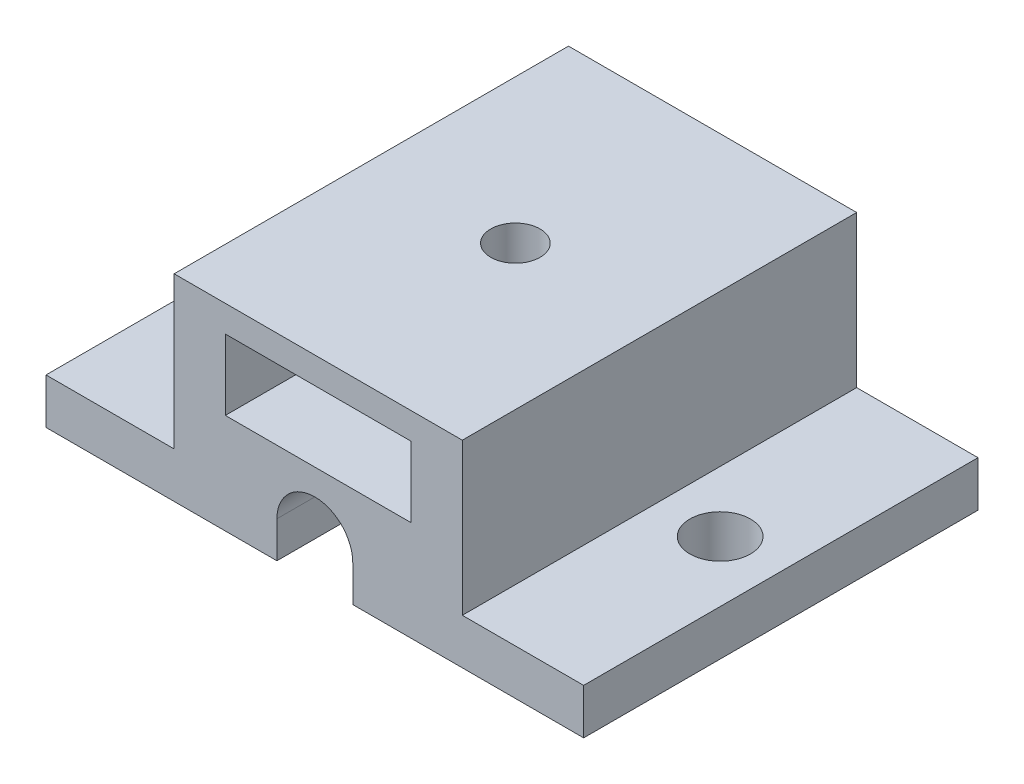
ISO-10303-21;
HEADER;
FILE_DESCRIPTION(('STEP AP214'),'2;1');
FILE_NAME('part.step','',(''),(''),'','','');
FILE_SCHEMA(('AUTOMOTIVE_DESIGN { 1 0 10303 214 1 1 1 1 }'));
ENDSEC;
DATA;
#1=APPLICATION_CONTEXT('core data for automotive mechanical design processes');
#2=APPLICATION_PROTOCOL_DEFINITION('international standard','automotive_design',2000,#1);
#3=PRODUCT_CONTEXT('',#1,'mechanical');
#4=PRODUCT('Part','Part','',(#3));
#5=PRODUCT_RELATED_PRODUCT_CATEGORY('part','',(#4));
#6=PRODUCT_DEFINITION_FORMATION('','',#4);
#7=PRODUCT_DEFINITION_CONTEXT('part definition',#1,'design');
#8=PRODUCT_DEFINITION('design','',#6,#7);
#9=PRODUCT_DEFINITION_SHAPE('','',#8);
#10=(LENGTH_UNIT() NAMED_UNIT(*) SI_UNIT(.MILLI.,.METRE.));
#11=(NAMED_UNIT(*) PLANE_ANGLE_UNIT() SI_UNIT($,.RADIAN.));
#12=(NAMED_UNIT(*) SI_UNIT($,.STERADIAN.) SOLID_ANGLE_UNIT());
#13=UNCERTAINTY_MEASURE_WITH_UNIT(LENGTH_MEASURE(1.E-05),#10,'distance_accuracy_value','');
#14=(GEOMETRIC_REPRESENTATION_CONTEXT(3) GLOBAL_UNCERTAINTY_ASSIGNED_CONTEXT((#13)) GLOBAL_UNIT_ASSIGNED_CONTEXT((#10,
#11,#12)) REPRESENTATION_CONTEXT('',''));
#15=CARTESIAN_POINT('',(0.,0.,0.));
#16=DIRECTION('',(0.,0.,1.));
#17=DIRECTION('',(1.,0.,0.));
#18=AXIS2_PLACEMENT_3D('',#15,#16,#17);
#19=CARTESIAN_POINT('',(35.4483122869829,0.,26.));
#20=DIRECTION('',(0.,1.,0.));
#21=DIRECTION('',(0.,0.,1.));
#22=AXIS2_PLACEMENT_3D('',#19,#20,#21);
#23=PLANE('',#22);
#24=CARTESIAN_POINT('',(4.,0.,13.));
#25=DIRECTION('',(0.,1.,0.));
#26=DIRECTION('',(0.,0.,1.));
#27=AXIS2_PLACEMENT_3D('',#24,#25,#26);
#28=CIRCLE('',#27,2.);
#29=CARTESIAN_POINT('',(4.,0.,15.));
#30=VERTEX_POINT('',#29);
#31=EDGE_CURVE('E251',#30,#30,#28,.T.);
#32=ORIENTED_EDGE('',*,*,#31,.T.);
#33=EDGE_LOOP('',(#32));
#34=FACE_BOUND('',#33,.T.);
#35=DIRECTION('',(1.,0.,0.));
#36=VECTOR('',#35,1.);
#37=CARTESIAN_POINT('',(35.4483122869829,0.,0.));
#38=LINE('',#37,#36);
#39=CARTESIAN_POINT('',(0.,0.,0.));
#40=VERTEX_POINT('',#39);
#41=CARTESIAN_POINT('',(15.225,0.,0.));
#42=VERTEX_POINT('',#41);
#43=EDGE_CURVE('E290',#40,#42,#38,.T.);
#44=ORIENTED_EDGE('',*,*,#43,.T.);
#45=DIRECTION('',(0.,0.,-1.));
#46=VECTOR('',#45,1.);
#47=CARTESIAN_POINT('',(15.225,0.,26.));
#48=LINE('',#47,#46);
#49=CARTESIAN_POINT('',(15.225,0.,26.));
#50=VERTEX_POINT('',#49);
#51=EDGE_CURVE('E238',#50,#42,#48,.T.);
#52=ORIENTED_EDGE('',*,*,#51,.F.);
#53=DIRECTION('',(1.,0.,0.));
#54=VECTOR('',#53,1.);
#55=CARTESIAN_POINT('',(35.4483122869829,0.,26.));
#56=LINE('',#55,#54);
#57=CARTESIAN_POINT('',(0.,0.,26.));
#58=VERTEX_POINT('',#57);
#59=EDGE_CURVE('E263',#58,#50,#56,.T.);
#60=ORIENTED_EDGE('',*,*,#59,.F.);
#61=DIRECTION('',(0.,0.,-1.));
#62=VECTOR('',#61,1.);
#63=CARTESIAN_POINT('',(0.,0.,26.));
#64=LINE('',#63,#62);
#65=EDGE_CURVE('E289',#58,#40,#64,.T.);
#66=ORIENTED_EDGE('',*,*,#65,.T.);
#67=EDGE_LOOP('',(#44,#52,#60,#66));
#68=FACE_BOUND('',#67,.T.);
#69=ADVANCED_FACE('F38',(#34,#68),#23,.F.);
#70=CARTESIAN_POINT('',(31.4483122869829,0.,13.));
#71=DIRECTION('',(0.,1.,0.));
#72=DIRECTION('',(0.,0.,1.));
#73=AXIS2_PLACEMENT_3D('',#70,#71,#72);
#74=CIRCLE('',#73,2.00000000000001);
#75=CARTESIAN_POINT('',(31.4483122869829,0.,15.));
#76=VERTEX_POINT('',#75);
#77=EDGE_CURVE('E258',#76,#76,#74,.T.);
#78=ORIENTED_EDGE('',*,*,#77,.T.);
#79=EDGE_LOOP('',(#78));
#80=FACE_BOUND('',#79,.T.);
#81=CARTESIAN_POINT('',(20.225,0.,26.));
#82=VERTEX_POINT('',#81);
#83=CARTESIAN_POINT('',(35.4483122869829,0.,26.));
#84=VERTEX_POINT('',#83);
#85=EDGE_CURVE('E268',#82,#84,#56,.T.);
#86=ORIENTED_EDGE('',*,*,#85,.F.);
#87=DIRECTION('',(0.,0.,-1.));
#88=VECTOR('',#87,1.);
#89=CARTESIAN_POINT('',(20.225,0.,26.));
#90=LINE('',#89,#88);
#91=CARTESIAN_POINT('',(20.225,0.,0.));
#92=VERTEX_POINT('',#91);
#93=EDGE_CURVE('E241',#82,#92,#90,.T.);
#94=ORIENTED_EDGE('',*,*,#93,.T.);
#95=CARTESIAN_POINT('',(35.4483122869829,0.,0.));
#96=VERTEX_POINT('',#95);
#97=EDGE_CURVE('E262',#92,#96,#38,.T.);
#98=ORIENTED_EDGE('',*,*,#97,.T.);
#99=DIRECTION('',(0.,0.,-1.));
#100=VECTOR('',#99,1.);
#101=CARTESIAN_POINT('',(35.4483122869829,0.,26.));
#102=LINE('',#101,#100);
#103=EDGE_CURVE('E11',#84,#96,#102,.T.);
#104=ORIENTED_EDGE('',*,*,#103,.F.);
#105=EDGE_LOOP('',(#86,#94,#98,#104));
#106=FACE_BOUND('',#105,.T.);
#107=ADVANCED_FACE('F40',(#80,#106),#23,.F.);
#108=CARTESIAN_POINT('',(35.4483122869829,0.,26.));
#109=DIRECTION('',(-1.,0.,0.));
#110=DIRECTION('',(0.,-1.,0.));
#111=AXIS2_PLACEMENT_3D('',#108,#109,#110);
#112=PLANE('',#111);
#113=DIRECTION('',(0.,1.,0.));
#114=VECTOR('',#113,1.);
#115=CARTESIAN_POINT('',(35.4483122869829,0.,0.));
#116=LINE('',#115,#114);
#117=CARTESIAN_POINT('',(35.4483122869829,3.,0.));
#118=VERTEX_POINT('',#117);
#119=EDGE_CURVE('E294',#96,#118,#116,.T.);
#120=ORIENTED_EDGE('',*,*,#119,.T.);
#121=DIRECTION('',(0.,0.,-1.));
#122=VECTOR('',#121,1.);
#123=CARTESIAN_POINT('',(35.4483122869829,3.,26.));
#124=LINE('',#123,#122);
#125=CARTESIAN_POINT('',(35.4483122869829,3.,26.));
#126=VERTEX_POINT('',#125);
#127=EDGE_CURVE('E53',#126,#118,#124,.T.);
#128=ORIENTED_EDGE('',*,*,#127,.F.);
#129=DIRECTION('',(0.,1.,0.));
#130=VECTOR('',#129,1.);
#131=CARTESIAN_POINT('',(35.4483122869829,0.,26.));
#132=LINE('',#131,#130);
#133=EDGE_CURVE('E267',#84,#126,#132,.T.);
#134=ORIENTED_EDGE('',*,*,#133,.F.);
#135=ORIENTED_EDGE('',*,*,#103,.T.);
#136=EDGE_LOOP('',(#120,#128,#134,#135));
#137=FACE_BOUND('',#136,.T.);
#138=ADVANCED_FACE('F369',(#137),#112,.F.);
#139=CARTESIAN_POINT('',(35.4483122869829,3.,26.));
#140=DIRECTION('',(0.,-1.,0.));
#141=DIRECTION('',(1.,0.,0.));
#142=AXIS2_PLACEMENT_3D('',#139,#140,#141);
#143=PLANE('',#142);
#144=CARTESIAN_POINT('',(31.4483122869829,3.,13.));
#145=DIRECTION('',(0.,1.,0.));
#146=DIRECTION('',(0.,0.,1.));
#147=AXIS2_PLACEMENT_3D('',#144,#145,#146);
#148=CIRCLE('',#147,2.00000000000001);
#149=CARTESIAN_POINT('',(31.4483122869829,3.,15.));
#150=VERTEX_POINT('',#149);
#151=EDGE_CURVE('E237',#150,#150,#148,.T.);
#152=ORIENTED_EDGE('',*,*,#151,.F.);
#153=EDGE_LOOP('',(#152));
#154=FACE_BOUND('',#153,.T.);
#155=DIRECTION('',(-1.,0.,0.));
#156=VECTOR('',#155,1.);
#157=CARTESIAN_POINT('',(35.4483122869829,3.,0.));
#158=LINE('',#157,#156);
#159=CARTESIAN_POINT('',(27.4483122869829,3.,0.));
#160=VERTEX_POINT('',#159);
#161=EDGE_CURVE('E297',#118,#160,#158,.T.);
#162=ORIENTED_EDGE('',*,*,#161,.T.);
#163=DIRECTION('',(0.,0.,-1.));
#164=VECTOR('',#163,1.);
#165=CARTESIAN_POINT('',(27.4483122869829,3.,26.));
#166=LINE('',#165,#164);
#167=CARTESIAN_POINT('',(27.4483122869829,3.,26.));
#168=VERTEX_POINT('',#167);
#169=EDGE_CURVE('E334',#168,#160,#166,.T.);
#170=ORIENTED_EDGE('',*,*,#169,.F.);
#171=DIRECTION('',(-1.,0.,0.));
#172=VECTOR('',#171,1.);
#173=CARTESIAN_POINT('',(35.4483122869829,3.,26.));
#174=LINE('',#173,#172);
#175=EDGE_CURVE('E271',#126,#168,#174,.T.);
#176=ORIENTED_EDGE('',*,*,#175,.F.);
#177=ORIENTED_EDGE('',*,*,#127,.T.);
#178=EDGE_LOOP('',(#162,#170,#176,#177));
#179=FACE_BOUND('',#178,.T.);
#180=ADVANCED_FACE('F344',(#154,#179),#143,.F.);
#181=CARTESIAN_POINT('',(27.4483122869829,3.,26.));
#182=DIRECTION('',(-1.,0.,0.));
#183=DIRECTION('',(0.,0.,1.));
#184=AXIS2_PLACEMENT_3D('',#181,#182,#183);
#185=PLANE('',#184);
#186=DIRECTION('',(0.,1.,0.));
#187=VECTOR('',#186,1.);
#188=CARTESIAN_POINT('',(27.4483122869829,3.,0.));
#189=LINE('',#188,#187);
#190=CARTESIAN_POINT('',(27.4483122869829,13.,0.));
#191=VERTEX_POINT('',#190);
#192=EDGE_CURVE('E300',#160,#191,#189,.T.);
#193=ORIENTED_EDGE('',*,*,#192,.T.);
#194=DIRECTION('',(0.,0.,-1.));
#195=VECTOR('',#194,1.);
#196=CARTESIAN_POINT('',(27.4483122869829,13.,26.));
#197=LINE('',#196,#195);
#198=CARTESIAN_POINT('',(27.4483122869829,13.,26.));
#199=VERTEX_POINT('',#198);
#200=EDGE_CURVE('E330',#199,#191,#197,.T.);
#201=ORIENTED_EDGE('',*,*,#200,.F.);
#202=DIRECTION('',(0.,1.,0.));
#203=VECTOR('',#202,1.);
#204=CARTESIAN_POINT('',(27.4483122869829,3.,26.));
#205=LINE('',#204,#203);
#206=EDGE_CURVE('E274',#168,#199,#205,.T.);
#207=ORIENTED_EDGE('',*,*,#206,.F.);
#208=ORIENTED_EDGE('',*,*,#169,.T.);
#209=EDGE_LOOP('',(#193,#201,#207,#208));
#210=FACE_BOUND('',#209,.T.);
#211=ADVANCED_FACE('F357',(#210),#185,.F.);
#212=CARTESIAN_POINT('',(27.4483122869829,13.,26.));
#213=DIRECTION('',(0.,-1.,0.));
#214=DIRECTION('',(0.,0.,-1.));
#215=AXIS2_PLACEMENT_3D('',#212,#213,#214);
#216=PLANE('',#215);
#217=CARTESIAN_POINT('',(17.9483122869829,13.,13.));
#218=DIRECTION('',(0.,1.,0.));
#219=DIRECTION('',(0.,0.,1.));
#220=AXIS2_PLACEMENT_3D('',#217,#218,#219);
#221=CIRCLE('',#220,1.625);
#222=CARTESIAN_POINT('',(17.9483122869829,13.,14.625));
#223=VERTEX_POINT('',#222);
#224=EDGE_CURVE('E203',#223,#223,#221,.T.);
#225=ORIENTED_EDGE('',*,*,#224,.F.);
#226=EDGE_LOOP('',(#225));
#227=FACE_BOUND('',#226,.T.);
#228=DIRECTION('',(-1.,0.,0.));
#229=VECTOR('',#228,1.);
#230=CARTESIAN_POINT('',(27.4483122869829,13.,0.));
#231=LINE('',#230,#229);
#232=CARTESIAN_POINT('',(8.44831228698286,13.,0.));
#233=VERTEX_POINT('',#232);
#234=EDGE_CURVE('E303',#191,#233,#231,.T.);
#235=ORIENTED_EDGE('',*,*,#234,.T.);
#236=DIRECTION('',(0.,0.,-1.));
#237=VECTOR('',#236,1.);
#238=CARTESIAN_POINT('',(8.44831228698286,13.,26.));
#239=LINE('',#238,#237);
#240=CARTESIAN_POINT('',(8.44831228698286,13.,26.));
#241=VERTEX_POINT('',#240);
#242=EDGE_CURVE('E326',#241,#233,#239,.T.);
#243=ORIENTED_EDGE('',*,*,#242,.F.);
#244=DIRECTION('',(-1.,0.,0.));
#245=VECTOR('',#244,1.);
#246=CARTESIAN_POINT('',(27.4483122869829,13.,26.));
#247=LINE('',#246,#245);
#248=EDGE_CURVE('E277',#199,#241,#247,.T.);
#249=ORIENTED_EDGE('',*,*,#248,.F.);
#250=ORIENTED_EDGE('',*,*,#200,.T.);
#251=EDGE_LOOP('',(#235,#243,#249,#250));
#252=FACE_BOUND('',#251,.T.);
#253=ADVANCED_FACE('F361',(#227,#252),#216,.F.);
#254=CARTESIAN_POINT('',(8.44831228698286,13.,26.));
#255=DIRECTION('',(1.,0.,0.));
#256=DIRECTION('',(0.,1.,0.));
#257=AXIS2_PLACEMENT_3D('',#254,#255,#256);
#258=PLANE('',#257);
#259=DIRECTION('',(0.,-1.,0.));
#260=VECTOR('',#259,1.);
#261=CARTESIAN_POINT('',(8.44831228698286,13.,0.));
#262=LINE('',#261,#260);
#263=CARTESIAN_POINT('',(8.44831228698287,3.,0.));
#264=VERTEX_POINT('',#263);
#265=EDGE_CURVE('E306',#233,#264,#262,.T.);
#266=ORIENTED_EDGE('',*,*,#265,.T.);
#267=DIRECTION('',(0.,0.,-1.));
#268=VECTOR('',#267,1.);
#269=CARTESIAN_POINT('',(8.44831228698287,3.,26.));
#270=LINE('',#269,#268);
#271=CARTESIAN_POINT('',(8.44831228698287,3.,26.));
#272=VERTEX_POINT('',#271);
#273=EDGE_CURVE('E322',#272,#264,#270,.T.);
#274=ORIENTED_EDGE('',*,*,#273,.F.);
#275=DIRECTION('',(0.,-1.,0.));
#276=VECTOR('',#275,1.);
#277=CARTESIAN_POINT('',(8.44831228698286,13.,26.));
#278=LINE('',#277,#276);
#279=EDGE_CURVE('E280',#241,#272,#278,.T.);
#280=ORIENTED_EDGE('',*,*,#279,.F.);
#281=ORIENTED_EDGE('',*,*,#242,.T.);
#282=EDGE_LOOP('',(#266,#274,#280,#281));
#283=FACE_BOUND('',#282,.T.);
#284=ADVANCED_FACE('F419',(#283),#258,.F.);
#285=CARTESIAN_POINT('',(8.44831228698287,3.,26.));
#286=DIRECTION('',(0.,-1.,0.));
#287=DIRECTION('',(1.,0.,0.));
#288=AXIS2_PLACEMENT_3D('',#285,#286,#287);
#289=PLANE('',#288);
#290=CARTESIAN_POINT('',(4.,3.,13.));
#291=DIRECTION('',(0.,1.,0.));
#292=DIRECTION('',(0.,0.,1.));
#293=AXIS2_PLACEMENT_3D('',#290,#291,#292);
#294=CIRCLE('',#293,2.);
#295=CARTESIAN_POINT('',(4.,3.,15.));
#296=VERTEX_POINT('',#295);
#297=EDGE_CURVE('E247',#296,#296,#294,.T.);
#298=ORIENTED_EDGE('',*,*,#297,.F.);
#299=EDGE_LOOP('',(#298));
#300=FACE_BOUND('',#299,.T.);
#301=DIRECTION('',(-1.,0.,0.));
#302=VECTOR('',#301,1.);
#303=CARTESIAN_POINT('',(8.44831228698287,3.,0.));
#304=LINE('',#303,#302);
#305=CARTESIAN_POINT('',(0.,3.,0.));
#306=VERTEX_POINT('',#305);
#307=EDGE_CURVE('E309',#264,#306,#304,.T.);
#308=ORIENTED_EDGE('',*,*,#307,.T.);
#309=DIRECTION('',(0.,0.,-1.));
#310=VECTOR('',#309,1.);
#311=CARTESIAN_POINT('',(0.,3.,26.));
#312=LINE('',#311,#310);
#313=CARTESIAN_POINT('',(0.,3.,26.));
#314=VERTEX_POINT('',#313);
#315=EDGE_CURVE('E318',#314,#306,#312,.T.);
#316=ORIENTED_EDGE('',*,*,#315,.F.);
#317=DIRECTION('',(-1.,0.,0.));
#318=VECTOR('',#317,1.);
#319=CARTESIAN_POINT('',(8.44831228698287,3.,26.));
#320=LINE('',#319,#318);
#321=EDGE_CURVE('E283',#272,#314,#320,.T.);
#322=ORIENTED_EDGE('',*,*,#321,.F.);
#323=ORIENTED_EDGE('',*,*,#273,.T.);
#324=EDGE_LOOP('',(#308,#316,#322,#323));
#325=FACE_BOUND('',#324,.T.);
#326=ADVANCED_FACE('F417',(#300,#325),#289,.F.);
#327=CARTESIAN_POINT('',(0.,3.,26.));
#328=DIRECTION('',(1.,0.,0.));
#329=DIRECTION('',(0.,1.,0.));
#330=AXIS2_PLACEMENT_3D('',#327,#328,#329);
#331=PLANE('',#330);
#332=DIRECTION('',(0.,-1.,0.));
#333=VECTOR('',#332,1.);
#334=CARTESIAN_POINT('',(0.,3.,0.));
#335=LINE('',#334,#333);
#336=EDGE_CURVE('E312',#306,#40,#335,.T.);
#337=ORIENTED_EDGE('',*,*,#336,.T.);
#338=ORIENTED_EDGE('',*,*,#65,.F.);
#339=DIRECTION('',(0.,-1.,0.));
#340=VECTOR('',#339,1.);
#341=CARTESIAN_POINT('',(0.,3.,26.));
#342=LINE('',#341,#340);
#343=EDGE_CURVE('E286',#314,#58,#342,.T.);
#344=ORIENTED_EDGE('',*,*,#343,.F.);
#345=ORIENTED_EDGE('',*,*,#315,.T.);
#346=EDGE_LOOP('',(#337,#338,#344,#345));
#347=FACE_BOUND('',#346,.T.);
#348=ADVANCED_FACE('F415',(#347),#331,.F.);
#349=CARTESIAN_POINT('',(0.,0.,26.));
#350=DIRECTION('',(0.,0.,1.));
#351=DIRECTION('',(1.,0.,0.));
#352=AXIS2_PLACEMENT_3D('',#349,#350,#351);
#353=PLANE('',#352);
#354=DIRECTION('',(0.,-1.,0.));
#355=VECTOR('',#354,1.);
#356=CARTESIAN_POINT('',(11.8233122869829,11.25,26.));
#357=LINE('',#356,#355);
#358=CARTESIAN_POINT('',(11.8233122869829,11.25,26.));
#359=VERTEX_POINT('',#358);
#360=CARTESIAN_POINT('',(11.8233122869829,6.6,26.));
#361=VERTEX_POINT('',#360);
#362=EDGE_CURVE('E60',#359,#361,#357,.T.);
#363=ORIENTED_EDGE('',*,*,#362,.F.);
#364=DIRECTION('',(-1.,0.,0.));
#365=VECTOR('',#364,1.);
#366=CARTESIAN_POINT('',(11.8233122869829,11.25,26.));
#367=LINE('',#366,#365);
#368=CARTESIAN_POINT('',(24.0733122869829,11.25,26.));
#369=VERTEX_POINT('',#368);
#370=EDGE_CURVE('E181',#369,#359,#367,.T.);
#371=ORIENTED_EDGE('',*,*,#370,.F.);
#372=DIRECTION('',(0.,1.,0.));
#373=VECTOR('',#372,1.);
#374=CARTESIAN_POINT('',(24.0733122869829,11.25,26.));
#375=LINE('',#374,#373);
#376=CARTESIAN_POINT('',(24.0733122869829,6.6,26.));
#377=VERTEX_POINT('',#376);
#378=EDGE_CURVE('E185',#377,#369,#375,.T.);
#379=ORIENTED_EDGE('',*,*,#378,.F.);
#380=DIRECTION('',(1.,0.,0.));
#381=VECTOR('',#380,1.);
#382=CARTESIAN_POINT('',(11.8233122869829,6.6,26.));
#383=LINE('',#382,#381);
#384=EDGE_CURVE('E194',#361,#377,#383,.T.);
#385=ORIENTED_EDGE('',*,*,#384,.F.);
#386=EDGE_LOOP('',(#363,#371,#379,#385));
#387=FACE_BOUND('',#386,.T.);
#388=DIRECTION('',(0.,1.,0.));
#389=VECTOR('',#388,1.);
#390=CARTESIAN_POINT('',(15.225,2.4,26.));
#391=LINE('',#390,#389);
#392=CARTESIAN_POINT('',(15.225,2.4,26.));
#393=VERTEX_POINT('',#392);
#394=EDGE_CURVE('E221',#50,#393,#391,.T.);
#395=ORIENTED_EDGE('',*,*,#394,.T.);
#396=CARTESIAN_POINT('',(17.725,2.4,26.));
#397=DIRECTION('',(0.,0.,-1.));
#398=DIRECTION('',(-1.,0.,0.));
#399=AXIS2_PLACEMENT_3D('',#396,#397,#398);
#400=CIRCLE('',#399,2.5);
#401=CARTESIAN_POINT('',(20.225,2.4,26.));
#402=VERTEX_POINT('',#401);
#403=EDGE_CURVE('E212',#393,#402,#400,.T.);
#404=ORIENTED_EDGE('',*,*,#403,.T.);
#405=DIRECTION('',(0.,-1.,0.));
#406=VECTOR('',#405,1.);
#407=CARTESIAN_POINT('',(20.225,2.4,26.));
#408=LINE('',#407,#406);
#409=EDGE_CURVE('E216',#402,#82,#408,.T.);
#410=ORIENTED_EDGE('',*,*,#409,.T.);
#411=ORIENTED_EDGE('',*,*,#85,.T.);
#412=ORIENTED_EDGE('',*,*,#133,.T.);
#413=ORIENTED_EDGE('',*,*,#175,.T.);
#414=ORIENTED_EDGE('',*,*,#206,.T.);
#415=ORIENTED_EDGE('',*,*,#248,.T.);
#416=ORIENTED_EDGE('',*,*,#279,.T.);
#417=ORIENTED_EDGE('',*,*,#321,.T.);
#418=ORIENTED_EDGE('',*,*,#343,.T.);
#419=ORIENTED_EDGE('',*,*,#59,.T.);
#420=EDGE_LOOP('',(#395,#404,#410,#411,#412,#413,#414,#415,#416,#417,#418,#419));
#421=FACE_BOUND('',#420,.T.);
#422=ADVANCED_FACE('F365',(#387,#421),#353,.T.);
#423=CARTESIAN_POINT('',(0.,0.,0.));
#424=DIRECTION('',(0.,0.,1.));
#425=DIRECTION('',(1.,0.,0.));
#426=AXIS2_PLACEMENT_3D('',#423,#424,#425);
#427=PLANE('',#426);
#428=CARTESIAN_POINT('',(17.725,2.4,0.));
#429=DIRECTION('',(0.,0.,-1.));
#430=DIRECTION('',(-1.,0.,0.));
#431=AXIS2_PLACEMENT_3D('',#428,#429,#430);
#432=CIRCLE('',#431,2.5);
#433=CARTESIAN_POINT('',(15.225,2.4,0.));
#434=VERTEX_POINT('',#433);
#435=CARTESIAN_POINT('',(20.225,2.4,0.));
#436=VERTEX_POINT('',#435);
#437=EDGE_CURVE('E68',#434,#436,#432,.T.);
#438=ORIENTED_EDGE('',*,*,#437,.F.);
#439=DIRECTION('',(0.,1.,0.));
#440=VECTOR('',#439,1.);
#441=CARTESIAN_POINT('',(15.225,2.4,0.));
#442=LINE('',#441,#440);
#443=EDGE_CURVE('E217',#42,#434,#442,.T.);
#444=ORIENTED_EDGE('',*,*,#443,.F.);
#445=ORIENTED_EDGE('',*,*,#43,.F.);
#446=ORIENTED_EDGE('',*,*,#336,.F.);
#447=ORIENTED_EDGE('',*,*,#307,.F.);
#448=ORIENTED_EDGE('',*,*,#265,.F.);
#449=ORIENTED_EDGE('',*,*,#234,.F.);
#450=ORIENTED_EDGE('',*,*,#192,.F.);
#451=ORIENTED_EDGE('',*,*,#161,.F.);
#452=ORIENTED_EDGE('',*,*,#119,.F.);
#453=ORIENTED_EDGE('',*,*,#97,.F.);
#454=DIRECTION('',(0.,-1.,0.));
#455=VECTOR('',#454,1.);
#456=CARTESIAN_POINT('',(20.225,2.4,0.));
#457=LINE('',#456,#455);
#458=EDGE_CURVE('E228',#436,#92,#457,.T.);
#459=ORIENTED_EDGE('',*,*,#458,.F.);
#460=EDGE_LOOP('',(#438,#444,#445,#446,#447,#448,#449,#450,#451,#452,#453,#459));
#461=FACE_BOUND('',#460,.T.);
#462=ADVANCED_FACE('F351',(#461),#427,.F.);
#463=CARTESIAN_POINT('',(4.,-17.,13.));
#464=DIRECTION('',(0.,1.,0.));
#465=DIRECTION('',(0.,0.,1.));
#466=AXIS2_PLACEMENT_3D('',#463,#464,#465);
#467=CYLINDRICAL_SURFACE('',#466,2.);
#468=ORIENTED_EDGE('',*,*,#297,.T.);
#469=EDGE_LOOP('',(#468));
#470=FACE_BOUND('',#469,.T.);
#471=ORIENTED_EDGE('',*,*,#31,.F.);
#472=EDGE_LOOP('',(#471));
#473=FACE_BOUND('',#472,.T.);
#474=ADVANCED_FACE('F540',(#470,#473),#467,.F.);
#475=CARTESIAN_POINT('',(31.4483122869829,-17.,13.));
#476=DIRECTION('',(0.,1.,0.));
#477=DIRECTION('',(0.,0.,1.));
#478=AXIS2_PLACEMENT_3D('',#475,#476,#477);
#479=CYLINDRICAL_SURFACE('',#478,2.00000000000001);
#480=ORIENTED_EDGE('',*,*,#151,.T.);
#481=EDGE_LOOP('',(#480));
#482=FACE_BOUND('',#481,.T.);
#483=ORIENTED_EDGE('',*,*,#77,.F.);
#484=EDGE_LOOP('',(#483));
#485=FACE_BOUND('',#484,.T.);
#486=ADVANCED_FACE('F468',(#482,#485),#479,.F.);
#487=CARTESIAN_POINT('',(17.725,2.4,26.));
#488=DIRECTION('',(0.,0.,-1.));
#489=DIRECTION('',(-1.,0.,0.));
#490=AXIS2_PLACEMENT_3D('',#487,#488,#489);
#491=CYLINDRICAL_SURFACE('',#490,2.5);
#492=CARTESIAN_POINT('',(17.9483122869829,4.89000634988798,14.625));
#493=CARTESIAN_POINT('',(18.0324630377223,4.88245195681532,14.6249919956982));
#494=CARTESIAN_POINT('',(18.1163573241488,4.87058699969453,14.6184139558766));
#495=CARTESIAN_POINT('',(18.2808107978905,4.83888067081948,14.5928095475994));
#496=CARTESIAN_POINT('',(18.3613588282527,4.81901466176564,14.5737446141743));
#497=CARTESIAN_POINT('',(18.5163773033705,4.77280856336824,14.5246292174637));
#498=CARTESIAN_POINT('',(18.5908844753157,4.74651223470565,14.494652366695));
#499=CARTESIAN_POINT('',(18.73310019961,4.68902240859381,14.425132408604));
#500=CARTESIAN_POINT('',(18.8008128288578,4.65783187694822,14.3855950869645));
#501=CARTESIAN_POINT('',(18.9359324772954,4.58861145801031,14.2933095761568));
#502=CARTESIAN_POINT('',(19.0024767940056,4.55020667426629,14.239583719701));
#503=CARTESIAN_POINT('',(19.1260571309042,4.47181370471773,14.1228473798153));
#504=CARTESIAN_POINT('',(19.183070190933,4.43182197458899,14.0598151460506));
#505=CARTESIAN_POINT('',(19.2957167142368,4.3464394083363,13.9137984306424));
#506=CARTESIAN_POINT('',(19.3495008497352,4.30127354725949,13.8292415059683));
#507=CARTESIAN_POINT('',(19.4415968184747,4.21854720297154,13.6487726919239));
#508=CARTESIAN_POINT('',(19.4799631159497,4.18096018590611,13.5529023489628));
#509=CARTESIAN_POINT('',(19.5267396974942,4.13331390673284,13.3913794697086));
#510=CARTESIAN_POINT('',(19.5409948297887,4.11825361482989,13.3289072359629));
#511=CARTESIAN_POINT('',(19.5620664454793,4.09570937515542,13.2014358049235));
#512=CARTESIAN_POINT('',(19.5688976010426,4.08821048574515,13.1364418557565));
#513=CARTESIAN_POINT('',(19.5746311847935,4.08192974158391,13.0053787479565));
#514=CARTESIAN_POINT('',(19.5734991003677,4.08318583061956,12.9393061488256));
#515=CARTESIAN_POINT('',(19.5633243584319,4.09428848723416,12.8084812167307));
#516=CARTESIAN_POINT('',(19.5542724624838,4.10414508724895,12.7437305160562));
#517=CARTESIAN_POINT('',(19.5262416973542,4.13378726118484,12.6039408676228));
#518=CARTESIAN_POINT('',(19.5055756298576,4.15522487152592,12.5296016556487));
#519=CARTESIAN_POINT('',(19.4550143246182,4.20507822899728,12.3866011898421));
#520=CARTESIAN_POINT('',(19.4250974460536,4.23351030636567,12.3179537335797));
#521=CARTESIAN_POINT('',(19.3453757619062,4.30476424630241,12.1641047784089));
#522=CARTESIAN_POINT('',(19.2922702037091,4.34916838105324,12.0813515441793));
#523=CARTESIAN_POINT('',(19.1726880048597,4.4395691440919,11.9271258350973));
#524=CARTESIAN_POINT('',(19.1061980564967,4.48556731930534,11.8556647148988));
#525=CARTESIAN_POINT('',(18.9597161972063,4.57553508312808,11.724276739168));
#526=CARTESIAN_POINT('',(18.8795792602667,4.61947563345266,11.6644903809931));
#527=CARTESIAN_POINT('',(18.7073436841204,4.70087396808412,11.5596509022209));
#528=CARTESIAN_POINT('',(18.6152720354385,4.73834594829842,11.5145653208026));
#529=CARTESIAN_POINT('',(18.445441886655,4.79517726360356,11.4509559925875));
#530=CARTESIAN_POINT('',(18.3698414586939,4.81672310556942,11.4286119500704));
#531=CARTESIAN_POINT('',(18.2146126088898,4.85287790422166,11.3950079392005));
#532=CARTESIAN_POINT('',(18.1349870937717,4.86749178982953,11.3837400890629));
#533=CARTESIAN_POINT('',(17.9735964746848,4.8889452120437,11.373179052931));
#534=CARTESIAN_POINT('',(17.8918247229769,4.89575668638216,11.3739289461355));
#535=CARTESIAN_POINT('',(17.7290546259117,4.90132248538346,11.387789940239));
#536=CARTESIAN_POINT('',(17.6480563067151,4.90007653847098,11.4009014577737));
#537=CARTESIAN_POINT('',(17.4939284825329,4.8904290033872,11.4379216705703));
#538=CARTESIAN_POINT('',(17.4206131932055,4.88243701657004,11.4611762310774));
#539=CARTESIAN_POINT('',(17.2787065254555,4.86088970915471,11.5174067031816));
#540=CARTESIAN_POINT('',(17.2101160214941,4.84733336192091,11.550384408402));
#541=CARTESIAN_POINT('',(17.0743449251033,4.81492343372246,11.6276558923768));
#542=CARTESIAN_POINT('',(17.0075969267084,4.79576615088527,11.6725788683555));
#543=CARTESIAN_POINT('',(16.8819648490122,4.75450042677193,11.7712132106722));
#544=CARTESIAN_POINT('',(16.8230859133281,4.73239007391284,11.8249302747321));
#545=CARTESIAN_POINT('',(16.7064476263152,4.68408838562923,11.9480765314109));
#546=CARTESIAN_POINT('',(16.6499514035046,4.65775347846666,12.0186503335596));
#547=CARTESIAN_POINT('',(16.5491174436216,4.60691996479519,12.1687015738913));
#548=CARTESIAN_POINT('',(16.5047892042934,4.58242280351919,12.2481858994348));
#549=CARTESIAN_POINT('',(16.4280906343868,4.53777509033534,12.4181237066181));
#550=CARTESIAN_POINT('',(16.3962786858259,4.51784131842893,12.5088914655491));
#551=CARTESIAN_POINT('',(16.3490959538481,4.4875125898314,12.6960462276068));
#552=CARTESIAN_POINT('',(16.3336865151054,4.47709521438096,12.7924194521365));
#553=CARTESIAN_POINT('',(16.3214429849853,4.46883104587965,12.9721610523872));
#554=CARTESIAN_POINT('',(16.3221513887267,4.46932092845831,13.0552911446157));
#555=CARTESIAN_POINT('',(16.3361539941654,4.47874382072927,13.2200065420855));
#556=CARTESIAN_POINT('',(16.34945221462,4.48767952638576,13.3015913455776));
#557=CARTESIAN_POINT('',(16.3864780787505,4.51158594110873,13.4550747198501));
#558=CARTESIAN_POINT('',(16.4093957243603,4.52608165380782,13.5272493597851));
#559=CARTESIAN_POINT('',(16.4645620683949,4.55924290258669,13.666897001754));
#560=CARTESIAN_POINT('',(16.496813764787,4.57790977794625,13.7343684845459));
#561=CARTESIAN_POINT('',(16.5752130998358,4.62041706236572,13.8731965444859));
#562=CARTESIAN_POINT('',(16.6227006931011,4.6446149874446,13.9436869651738));
#563=CARTESIAN_POINT('',(16.7280055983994,4.6933323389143,14.0764120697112));
#564=CARTESIAN_POINT('',(16.7858311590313,4.71785200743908,14.1386400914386));
#565=CARTESIAN_POINT('',(16.9182978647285,4.76744337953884,14.2604345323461));
#566=CARTESIAN_POINT('',(16.9941129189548,4.79224704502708,14.318847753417));
#567=CARTESIAN_POINT('',(17.15610504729,4.83585472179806,14.4220579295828));
#568=CARTESIAN_POINT('',(17.2422800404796,4.85465993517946,14.4668576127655));
#569=CARTESIAN_POINT('',(17.415793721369,4.88223244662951,14.5378972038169));
#570=CARTESIAN_POINT('',(17.5025456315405,4.89165430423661,14.56528937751));
#571=CARTESIAN_POINT('',(17.6353139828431,4.89878682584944,14.5952192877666));
#572=CARTESIAN_POINT('',(17.6799642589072,4.89999989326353,14.60333364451));
#573=CARTESIAN_POINT('',(17.769778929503,4.90000010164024,14.615796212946));
#574=CARTESIAN_POINT('',(17.8149429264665,4.89878900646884,14.6201471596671));
#575=CARTESIAN_POINT('',(17.8895251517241,4.8947556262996,14.6242048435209));
#576=CARTESIAN_POINT('',(17.9189343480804,4.89264367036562,14.6250027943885));
#577=CARTESIAN_POINT('',(17.9483122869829,4.89000634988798,14.625));
#578=B_SPLINE_CURVE_WITH_KNOTS('',3,(#492,#493,#494,#495,#496,#497,#498,#499,#500,#501,#502,
#503,#504,#505,#506,#507,#508,#509,#510,#511,#512,#513,#514,#515,#516,#517,#518,#519,#520,#521,
#522,#523,#524,#525,#526,#527,#528,#529,#530,#531,#532,#533,#534,#535,#536,#537,#538,#539,#540,
#541,#542,#543,#544,#545,#546,#547,#548,#549,#550,#551,#552,#553,#554,#555,#556,#557,#558,#559,
#560,#561,#562,#563,#564,#565,#566,#567,#568,#569,#570,#571,#572,#573,#574,#575,#576,#577),
.UNSPECIFIED.,.T.,.F.,(4,2,2,2,2,2,2,2,2,2,2,2,2,2,2,2,2,2,2,2,2,2,2,2,2,2,2,2,2,2,2,2,2,2,2,2,
2,2,2,2,2,2,4),(0.,0.253357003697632,0.507500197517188,0.759959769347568,1.01226694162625,
1.29248946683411,1.57337759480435,1.90156995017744,2.22859253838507,2.42531310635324,
2.62164418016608,2.81882667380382,3.01623948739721,3.25516453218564,3.49465278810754,
3.81667617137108,4.13902132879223,4.46503435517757,4.79032255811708,5.03447481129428,
5.27845320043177,5.52330635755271,5.76816776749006,5.99914986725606,6.23017460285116,
6.47732500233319,6.72463616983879,7.005895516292,7.28737378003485,7.58027684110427,
7.87248808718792,8.12049191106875,8.36857492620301,8.59899425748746,8.82948767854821,
9.09356248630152,9.35784894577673,9.65290239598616,9.94789667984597,10.2204591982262,
10.3564689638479,10.4923798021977,10.5808294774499),.UNSPECIFIED.);
#579=CARTESIAN_POINT('',(17.9483122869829,4.89000634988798,14.625));
#580=VERTEX_POINT('',#579);
#581=EDGE_CURVE('E42',#580,#580,#578,.T.);
#582=ORIENTED_EDGE('',*,*,#581,.T.);
#583=EDGE_LOOP('',(#582));
#584=FACE_BOUND('',#583,.T.);
#585=ORIENTED_EDGE('',*,*,#437,.T.);
#586=DIRECTION('',(0.,0.,-1.));
#587=VECTOR('',#586,1.);
#588=CARTESIAN_POINT('',(20.225,2.4,26.));
#589=LINE('',#588,#587);
#590=EDGE_CURVE('E225',#402,#436,#589,.T.);
#591=ORIENTED_EDGE('',*,*,#590,.F.);
#592=ORIENTED_EDGE('',*,*,#403,.F.);
#593=DIRECTION('',(0.,0.,-1.));
#594=VECTOR('',#593,1.);
#595=CARTESIAN_POINT('',(15.225,2.4,26.));
#596=LINE('',#595,#594);
#597=EDGE_CURVE('E234',#393,#434,#596,.T.);
#598=ORIENTED_EDGE('',*,*,#597,.T.);
#599=EDGE_LOOP('',(#585,#591,#592,#598));
#600=FACE_BOUND('',#599,.T.);
#601=ADVANCED_FACE('F377',(#584,#600),#491,.F.);
#602=CARTESIAN_POINT('',(15.225,2.4,26.));
#603=DIRECTION('',(-1.,0.,0.));
#604=DIRECTION('',(0.,0.,1.));
#605=AXIS2_PLACEMENT_3D('',#602,#603,#604);
#606=PLANE('',#605);
#607=ORIENTED_EDGE('',*,*,#443,.T.);
#608=ORIENTED_EDGE('',*,*,#597,.F.);
#609=ORIENTED_EDGE('',*,*,#394,.F.);
#610=ORIENTED_EDGE('',*,*,#51,.T.);
#611=EDGE_LOOP('',(#607,#608,#609,#610));
#612=FACE_BOUND('',#611,.T.);
#613=ADVANCED_FACE('F389',(#612),#606,.F.);
#614=CARTESIAN_POINT('',(20.225,2.4,26.));
#615=DIRECTION('',(1.,0.,0.));
#616=DIRECTION('',(0.,0.,-1.));
#617=AXIS2_PLACEMENT_3D('',#614,#615,#616);
#618=PLANE('',#617);
#619=ORIENTED_EDGE('',*,*,#458,.T.);
#620=ORIENTED_EDGE('',*,*,#93,.F.);
#621=ORIENTED_EDGE('',*,*,#409,.F.);
#622=ORIENTED_EDGE('',*,*,#590,.T.);
#623=EDGE_LOOP('',(#619,#620,#621,#622));
#624=FACE_BOUND('',#623,.T.);
#625=ADVANCED_FACE('F381',(#624),#618,.F.);
#626=CARTESIAN_POINT('',(17.9483122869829,0.,13.));
#627=DIRECTION('',(0.,1.,0.));
#628=DIRECTION('',(0.,0.,1.));
#629=AXIS2_PLACEMENT_3D('',#626,#627,#628);
#630=CYLINDRICAL_SURFACE('',#629,1.625);
#631=ORIENTED_EDGE('',*,*,#224,.T.);
#632=EDGE_LOOP('',(#631));
#633=FACE_BOUND('',#632,.T.);
#634=ORIENTED_EDGE('',*,*,#581,.F.);
#635=EDGE_LOOP('',(#634));
#636=FACE_BOUND('',#635,.T.);
#637=ADVANCED_FACE('F379',(#633,#636),#630,.F.);
#638=CARTESIAN_POINT('',(11.8233122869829,11.25,16.));
#639=DIRECTION('',(-1.,0.,0.));
#640=DIRECTION('',(0.,0.,1.));
#641=AXIS2_PLACEMENT_3D('',#638,#639,#640);
#642=PLANE('',#641);
#643=ORIENTED_EDGE('',*,*,#362,.T.);
#644=DIRECTION('',(0.,0.,1.));
#645=VECTOR('',#644,1.);
#646=CARTESIAN_POINT('',(11.8233122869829,6.6,16.));
#647=LINE('',#646,#645);
#648=CARTESIAN_POINT('',(11.8233122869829,6.6,16.));
#649=VERTEX_POINT('',#648);
#650=EDGE_CURVE('E156',#649,#361,#647,.T.);
#651=ORIENTED_EDGE('',*,*,#650,.F.);
#652=DIRECTION('',(0.,-1.,0.));
#653=VECTOR('',#652,1.);
#654=CARTESIAN_POINT('',(11.8233122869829,11.25,16.));
#655=LINE('',#654,#653);
#656=CARTESIAN_POINT('',(11.8233122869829,11.25,16.));
#657=VERTEX_POINT('',#656);
#658=EDGE_CURVE('E160',#657,#649,#655,.T.);
#659=ORIENTED_EDGE('',*,*,#658,.F.);
#660=DIRECTION('',(0.,0.,1.));
#661=VECTOR('',#660,1.);
#662=CARTESIAN_POINT('',(11.8233122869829,11.25,16.));
#663=LINE('',#662,#661);
#664=EDGE_CURVE('E200',#657,#359,#663,.T.);
#665=ORIENTED_EDGE('',*,*,#664,.T.);
#666=EDGE_LOOP('',(#643,#651,#659,#665));
#667=FACE_BOUND('',#666,.T.);
#668=ADVANCED_FACE('F158',(#667),#642,.F.);
#669=CARTESIAN_POINT('',(11.8233122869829,11.25,16.));
#670=DIRECTION('',(0.,1.,0.));
#671=DIRECTION('',(-1.,0.,0.));
#672=AXIS2_PLACEMENT_3D('',#669,#670,#671);
#673=PLANE('',#672);
#674=ORIENTED_EDGE('',*,*,#370,.T.);
#675=ORIENTED_EDGE('',*,*,#664,.F.);
#676=DIRECTION('',(-1.,0.,0.));
#677=VECTOR('',#676,1.);
#678=CARTESIAN_POINT('',(11.8233122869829,11.25,16.));
#679=LINE('',#678,#677);
#680=CARTESIAN_POINT('',(24.0733122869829,11.25,16.));
#681=VERTEX_POINT('',#680);
#682=EDGE_CURVE('E167',#681,#657,#679,.T.);
#683=ORIENTED_EDGE('',*,*,#682,.F.);
#684=DIRECTION('',(0.,0.,1.));
#685=VECTOR('',#684,1.);
#686=CARTESIAN_POINT('',(24.0733122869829,11.25,16.));
#687=LINE('',#686,#685);
#688=EDGE_CURVE('E204',#681,#369,#687,.T.);
#689=ORIENTED_EDGE('',*,*,#688,.T.);
#690=EDGE_LOOP('',(#674,#675,#683,#689));
#691=FACE_BOUND('',#690,.T.);
#692=ADVANCED_FACE('F387',(#691),#673,.F.);
#693=CARTESIAN_POINT('',(24.0733122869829,11.25,16.));
#694=DIRECTION('',(1.,0.,0.));
#695=DIRECTION('',(0.,0.,-1.));
#696=AXIS2_PLACEMENT_3D('',#693,#694,#695);
#697=PLANE('',#696);
#698=ORIENTED_EDGE('',*,*,#378,.T.);
#699=ORIENTED_EDGE('',*,*,#688,.F.);
#700=DIRECTION('',(0.,1.,0.));
#701=VECTOR('',#700,1.);
#702=CARTESIAN_POINT('',(24.0733122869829,11.25,16.));
#703=LINE('',#702,#701);
#704=CARTESIAN_POINT('',(24.0733122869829,6.6,16.));
#705=VERTEX_POINT('',#704);
#706=EDGE_CURVE('E176',#705,#681,#703,.T.);
#707=ORIENTED_EDGE('',*,*,#706,.F.);
#708=DIRECTION('',(0.,0.,1.));
#709=VECTOR('',#708,1.);
#710=CARTESIAN_POINT('',(24.0733122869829,6.6,16.));
#711=LINE('',#710,#709);
#712=EDGE_CURVE('E166',#705,#377,#711,.T.);
#713=ORIENTED_EDGE('',*,*,#712,.T.);
#714=EDGE_LOOP('',(#698,#699,#707,#713));
#715=FACE_BOUND('',#714,.T.);
#716=ADVANCED_FACE('F500',(#715),#697,.F.);
#717=CARTESIAN_POINT('',(11.8233122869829,6.6,16.));
#718=DIRECTION('',(0.,-1.,0.));
#719=DIRECTION('',(1.,0.,0.));
#720=AXIS2_PLACEMENT_3D('',#717,#718,#719);
#721=PLANE('',#720);
#722=ORIENTED_EDGE('',*,*,#384,.T.);
#723=ORIENTED_EDGE('',*,*,#712,.F.);
#724=DIRECTION('',(1.,0.,0.));
#725=VECTOR('',#724,1.);
#726=CARTESIAN_POINT('',(11.8233122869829,6.6,16.));
#727=LINE('',#726,#725);
#728=EDGE_CURVE('E170',#649,#705,#727,.T.);
#729=ORIENTED_EDGE('',*,*,#728,.F.);
#730=ORIENTED_EDGE('',*,*,#650,.T.);
#731=EDGE_LOOP('',(#722,#723,#729,#730));
#732=FACE_BOUND('',#731,.T.);
#733=ADVANCED_FACE('F171',(#732),#721,.F.);
#734=CARTESIAN_POINT('',(0.,0.,16.));
#735=DIRECTION('',(0.,0.,1.));
#736=DIRECTION('',(1.,0.,0.));
#737=AXIS2_PLACEMENT_3D('',#734,#735,#736);
#738=PLANE('',#737);
#739=ORIENTED_EDGE('',*,*,#658,.T.);
#740=ORIENTED_EDGE('',*,*,#728,.T.);
#741=ORIENTED_EDGE('',*,*,#706,.T.);
#742=ORIENTED_EDGE('',*,*,#682,.T.);
#743=EDGE_LOOP('',(#739,#740,#741,#742));
#744=FACE_BOUND('',#743,.T.);
#745=ADVANCED_FACE('F178',(#744),#738,.T.);
#746=CLOSED_SHELL('',(#69,#107,#138,#180,#211,#253,#284,#326,#348,#422,#462,#474,#486,#601,#613,
#625,#637,#668,#692,#716,#733,#745));
#747=MANIFOLD_SOLID_BREP('B2',#746);
#748=ADVANCED_BREP_SHAPE_REPRESENTATION('',(#18,#747),#14);
#749=SHAPE_DEFINITION_REPRESENTATION(#9,#748);
ENDSEC;
END-ISO-10303-21;
